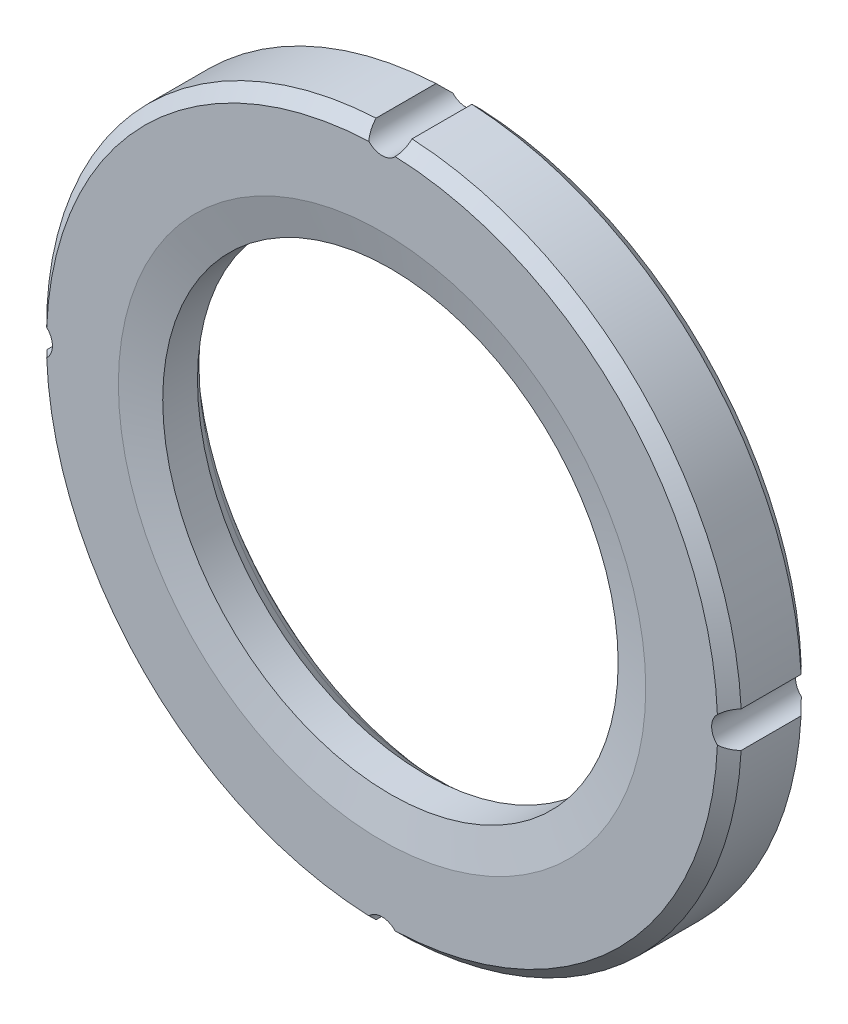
ISO-10303-21;
HEADER;
FILE_DESCRIPTION(('STEP AP214'),'2;1');
FILE_NAME('part.step','',(''),(''),'','','');
FILE_SCHEMA(('AUTOMOTIVE_DESIGN { 1 0 10303 214 1 1 1 1 }'));
ENDSEC;
DATA;
#1=APPLICATION_CONTEXT('core data for automotive mechanical design processes');
#2=APPLICATION_PROTOCOL_DEFINITION('international standard','automotive_design',2000,#1);
#3=PRODUCT_CONTEXT('',#1,'mechanical');
#4=PRODUCT('Part','Part','',(#3));
#5=PRODUCT_RELATED_PRODUCT_CATEGORY('part','',(#4));
#6=PRODUCT_DEFINITION_FORMATION('','',#4);
#7=PRODUCT_DEFINITION_CONTEXT('part definition',#1,'design');
#8=PRODUCT_DEFINITION('design','',#6,#7);
#9=PRODUCT_DEFINITION_SHAPE('','',#8);
#10=(LENGTH_UNIT() NAMED_UNIT(*) SI_UNIT(.MILLI.,.METRE.));
#11=(NAMED_UNIT(*) PLANE_ANGLE_UNIT() SI_UNIT($,.RADIAN.));
#12=(NAMED_UNIT(*) SI_UNIT($,.STERADIAN.) SOLID_ANGLE_UNIT());
#13=UNCERTAINTY_MEASURE_WITH_UNIT(LENGTH_MEASURE(1.E-05),#10,'distance_accuracy_value','');
#14=(GEOMETRIC_REPRESENTATION_CONTEXT(3) GLOBAL_UNCERTAINTY_ASSIGNED_CONTEXT((#13)) GLOBAL_UNIT_ASSIGNED_CONTEXT((#10,
#11,#12)) REPRESENTATION_CONTEXT('',''));
#15=CARTESIAN_POINT('',(0.,0.,0.));
#16=DIRECTION('',(0.,0.,1.));
#17=DIRECTION('',(1.,0.,0.));
#18=AXIS2_PLACEMENT_3D('',#15,#16,#17);
#19=CARTESIAN_POINT('',(22.7896017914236,0.,0.));
#20=DIRECTION('',(0.,0.,1.));
#21=DIRECTION('',(1.,0.,0.));
#22=AXIS2_PLACEMENT_3D('',#19,#20,#21);
#23=PLANE('',#22);
#24=CARTESIAN_POINT('',(0.,0.,0.));
#25=DIRECTION('',(0.,0.,-1.));
#26=DIRECTION('',(-1.,0.,0.));
#27=AXIS2_PLACEMENT_3D('',#24,#25,#26);
#28=CIRCLE('',#27,22.7896017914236);
#29=CARTESIAN_POINT('',(-22.7896017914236,0.,0.));
#30=VERTEX_POINT('',#29);
#31=EDGE_CURVE('E175',#30,#30,#28,.T.);
#32=ORIENTED_EDGE('',*,*,#31,.F.);
#33=EDGE_LOOP('',(#32));
#34=FACE_BOUND('',#33,.T.);
#35=CARTESIAN_POINT('',(-29.,0.,0.));
#36=DIRECTION('',(0.,0.,1.));
#37=DIRECTION('',(1.,0.,0.));
#38=AXIS2_PLACEMENT_3D('',#35,#36,#37);
#39=CIRCLE('',#38,1.5);
#40=CARTESIAN_POINT('',(-27.9784482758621,-1.09837701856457,0.));
#41=VERTEX_POINT('',#40);
#42=CARTESIAN_POINT('',(-27.9784482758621,1.09837701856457,0.));
#43=VERTEX_POINT('',#42);
#44=EDGE_CURVE('E143',#41,#43,#39,.T.);
#45=ORIENTED_EDGE('',*,*,#44,.T.);
#46=CARTESIAN_POINT('',(0.,0.,0.));
#47=DIRECTION('',(0.,0.,-1.));
#48=DIRECTION('',(-1.,0.,0.));
#49=AXIS2_PLACEMENT_3D('',#46,#47,#48);
#50=CIRCLE('',#49,28.);
#51=CARTESIAN_POINT('',(-1.09837701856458,27.9784482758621,0.));
#52=VERTEX_POINT('',#51);
#53=EDGE_CURVE('E168',#43,#52,#50,.T.);
#54=ORIENTED_EDGE('',*,*,#53,.T.);
#55=CARTESIAN_POINT('',(0.,29.,0.));
#56=DIRECTION('',(0.,0.,1.));
#57=DIRECTION('',(1.,0.,0.));
#58=AXIS2_PLACEMENT_3D('',#55,#56,#57);
#59=CIRCLE('',#58,1.5);
#60=CARTESIAN_POINT('',(1.09837701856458,27.9784482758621,0.));
#61=VERTEX_POINT('',#60);
#62=EDGE_CURVE('E340',#52,#61,#59,.T.);
#63=ORIENTED_EDGE('',*,*,#62,.T.);
#64=CARTESIAN_POINT('',(27.9784482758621,1.09837701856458,0.));
#65=VERTEX_POINT('',#64);
#66=EDGE_CURVE('E170',#61,#65,#50,.T.);
#67=ORIENTED_EDGE('',*,*,#66,.T.);
#68=CARTESIAN_POINT('',(29.,0.,0.));
#69=DIRECTION('',(0.,0.,1.));
#70=DIRECTION('',(1.,0.,0.));
#71=AXIS2_PLACEMENT_3D('',#68,#69,#70);
#72=CIRCLE('',#71,1.5);
#73=CARTESIAN_POINT('',(27.9784482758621,-1.0983770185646,0.));
#74=VERTEX_POINT('',#73);
#75=EDGE_CURVE('E436',#65,#74,#72,.T.);
#76=ORIENTED_EDGE('',*,*,#75,.T.);
#77=CARTESIAN_POINT('',(1.09837701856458,-27.9784482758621,0.));
#78=VERTEX_POINT('',#77);
#79=EDGE_CURVE('E167',#74,#78,#50,.T.);
#80=ORIENTED_EDGE('',*,*,#79,.T.);
#81=CARTESIAN_POINT('',(0.,-29.,0.));
#82=DIRECTION('',(0.,0.,1.));
#83=DIRECTION('',(1.,0.,0.));
#84=AXIS2_PLACEMENT_3D('',#81,#82,#83);
#85=CIRCLE('',#84,1.5);
#86=CARTESIAN_POINT('',(-1.09837701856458,-27.9784482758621,0.));
#87=VERTEX_POINT('',#86);
#88=EDGE_CURVE('E163',#78,#87,#85,.T.);
#89=ORIENTED_EDGE('',*,*,#88,.T.);
#90=EDGE_CURVE('E160',#87,#41,#50,.T.);
#91=ORIENTED_EDGE('',*,*,#90,.T.);
#92=EDGE_LOOP('',(#45,#54,#63,#67,#76,#80,#89,#91));
#93=FACE_BOUND('',#92,.T.);
#94=ADVANCED_FACE('F33',(#34,#93),#23,.F.);
#95=CARTESIAN_POINT('',(0.,0.,1.));
#96=DIRECTION('',(0.,0.,1.));
#97=DIRECTION('',(1.,0.,0.));
#98=AXIS2_PLACEMENT_3D('',#95,#96,#97);
#99=CONICAL_SURFACE('',#98,29.,0.785398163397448);
#100=CARTESIAN_POINT('',(-27.9782551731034,-1.09819739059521,-0.000199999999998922));
#101=CARTESIAN_POINT('',(-28.0157579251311,-1.13306937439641,0.0386435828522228));
#102=CARTESIAN_POINT('',(-28.0543848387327,-1.1654460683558,0.0785683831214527));
#103=CARTESIAN_POINT('',(-28.1334468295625,-1.22537929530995,0.160105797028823));
#104=CARTESIAN_POINT('',(-28.1738798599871,-1.25294111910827,0.201716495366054));
#105=CARTESIAN_POINT('',(-28.2554341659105,-1.30302180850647,0.285453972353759));
#106=CARTESIAN_POINT('',(-28.296528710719,-1.32562482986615,0.327556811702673));
#107=CARTESIAN_POINT('',(-28.3798356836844,-1.36658407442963,0.41271345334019));
#108=CARTESIAN_POINT('',(-28.4220484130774,-1.38493914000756,0.455767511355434));
#109=CARTESIAN_POINT('',(-28.5445590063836,-1.43174091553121,0.580430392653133));
#110=CARTESIAN_POINT('',(-28.6259829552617,-1.45503911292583,0.662935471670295));
#111=CARTESIAN_POINT('',(-28.7500755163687,-1.47964834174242,0.78812559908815));
#112=CARTESIAN_POINT('',(-28.7921498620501,-1.48613846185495,0.830478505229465));
#113=CARTESIAN_POINT('',(-28.8765901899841,-1.49551658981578,0.915290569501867));
#114=CARTESIAN_POINT('',(-28.918956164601,-1.49840469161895,0.957749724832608));
#115=CARTESIAN_POINT('',(-28.9614068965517,-1.49950344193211,1.00019999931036));
#116=B_SPLINE_CURVE_WITH_KNOTS('',3,(#100,#101,#102,#103,#104,#105,#106,#107,#108,#109,#110,
#111,#112,#113,#114,#115),.UNSPECIFIED.,.F.,.F.,(4,2,2,2,2,2,2,4),(0.,0.192694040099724,
0.38517498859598,0.574080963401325,0.763038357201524,1.11669354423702,1.29676096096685,
1.47682368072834),.UNSPECIFIED.);
#117=CARTESIAN_POINT('',(-28.9612068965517,-1.49949828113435,0.999999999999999));
#118=VERTEX_POINT('',#117);
#119=EDGE_CURVE('E146',#41,#118,#116,.T.);
#120=ORIENTED_EDGE('',*,*,#119,.F.);
#121=ORIENTED_EDGE('',*,*,#90,.F.);
#122=CARTESIAN_POINT('',(-1.49950344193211,-28.9614068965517,1.00019999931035));
#123=CARTESIAN_POINT('',(-1.49797297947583,-28.9026287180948,0.941424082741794));
#124=CARTESIAN_POINT('',(-1.49302163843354,-28.8439774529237,0.882592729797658));
#125=CARTESIAN_POINT('',(-1.47618187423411,-28.7272678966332,0.765169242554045));
#126=CARTESIAN_POINT('',(-1.46428351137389,-28.6692105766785,0.706577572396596));
#127=CARTESIAN_POINT('',(-1.43384977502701,-28.5556598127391,0.591633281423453));
#128=CARTESIAN_POINT('',(-1.41549066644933,-28.5001387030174,0.535261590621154));
#129=CARTESIAN_POINT('',(-1.37191508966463,-28.390641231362,0.42376291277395));
#130=CARTESIAN_POINT('',(-1.34670412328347,-28.3366636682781,0.368634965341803));
#131=CARTESIAN_POINT('',(-1.28904111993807,-28.2305603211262,0.259961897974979));
#132=CARTESIAN_POINT('',(-1.25656533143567,-28.1784412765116,0.206422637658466));
#133=CARTESIAN_POINT('',(-1.1835572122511,-28.0763361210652,0.101251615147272));
#134=CARTESIAN_POINT('',(-1.14292620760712,-28.0263862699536,0.0496534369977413));
#135=CARTESIAN_POINT('',(-1.09819739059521,-27.9782551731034,-0.000199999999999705));
#136=B_SPLINE_CURVE_WITH_KNOTS('',3,(#122,#123,#124,#125,#126,#127,#128,#129,#130,#131,#132,
#133,#134,#135),.UNSPECIFIED.,.F.,.F.,(4,2,2,2,2,2,4),(0.,0.249360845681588,0.499079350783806,
0.742454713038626,0.985635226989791,1.22962272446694,1.47676269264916),.UNSPECIFIED.);
#137=CARTESIAN_POINT('',(-1.49949828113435,-28.9612068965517,0.999999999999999));
#138=VERTEX_POINT('',#137);
#139=EDGE_CURVE('E197',#138,#87,#136,.T.);
#140=ORIENTED_EDGE('',*,*,#139,.F.);
#141=CARTESIAN_POINT('',(0.,0.,1.));
#142=DIRECTION('',(0.,0.,-1.));
#143=DIRECTION('',(-1.,0.,0.));
#144=AXIS2_PLACEMENT_3D('',#141,#142,#143);
#145=CIRCLE('',#144,29.);
#146=EDGE_CURVE('E162',#138,#118,#145,.T.);
#147=ORIENTED_EDGE('',*,*,#146,.T.);
#148=EDGE_LOOP('',(#120,#121,#140,#147));
#149=FACE_BOUND('',#148,.T.);
#150=ADVANCED_FACE('F158',(#149),#99,.T.);
#151=CARTESIAN_POINT('',(-28.9614068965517,1.49950344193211,1.00019999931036));
#152=CARTESIAN_POINT('',(-28.9026287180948,1.49797297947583,0.941424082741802));
#153=CARTESIAN_POINT('',(-28.8439774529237,1.49302163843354,0.882592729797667));
#154=CARTESIAN_POINT('',(-28.7272678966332,1.47618187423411,0.765169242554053));
#155=CARTESIAN_POINT('',(-28.6692105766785,1.46428351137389,0.706577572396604));
#156=CARTESIAN_POINT('',(-28.5556598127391,1.43384977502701,0.59163328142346));
#157=CARTESIAN_POINT('',(-28.5001387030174,1.41549066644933,0.535261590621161));
#158=CARTESIAN_POINT('',(-28.390641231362,1.37191508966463,0.423762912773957));
#159=CARTESIAN_POINT('',(-28.3366636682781,1.34670412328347,0.36863496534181));
#160=CARTESIAN_POINT('',(-28.2305603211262,1.28904111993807,0.259961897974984));
#161=CARTESIAN_POINT('',(-28.1784412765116,1.25656533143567,0.20642263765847));
#162=CARTESIAN_POINT('',(-28.0763361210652,1.18355721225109,0.101251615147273));
#163=CARTESIAN_POINT('',(-28.0263862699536,1.14292620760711,0.0496534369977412));
#164=CARTESIAN_POINT('',(-27.9782551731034,1.09819739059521,-0.000199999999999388));
#165=B_SPLINE_CURVE_WITH_KNOTS('',3,(#151,#152,#153,#154,#155,#156,#157,#158,#159,#160,#161,
#162,#163,#164),.UNSPECIFIED.,.F.,.F.,(4,2,2,2,2,2,4),(0.,0.249360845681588,0.499079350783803,
0.742454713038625,0.985635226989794,1.22962272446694,1.47676269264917),.UNSPECIFIED.);
#166=CARTESIAN_POINT('',(-28.9612068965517,1.49949828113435,0.999999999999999));
#167=VERTEX_POINT('',#166);
#168=EDGE_CURVE('E149',#167,#43,#165,.T.);
#169=ORIENTED_EDGE('',*,*,#168,.F.);
#170=CARTESIAN_POINT('',(-1.49949828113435,28.9612068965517,0.999999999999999));
#171=VERTEX_POINT('',#170);
#172=EDGE_CURVE('E212',#167,#171,#145,.T.);
#173=ORIENTED_EDGE('',*,*,#172,.T.);
#174=CARTESIAN_POINT('',(-1.09819739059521,27.9782551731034,-0.000199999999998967));
#175=CARTESIAN_POINT('',(-1.13306937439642,28.0157579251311,0.0386435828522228));
#176=CARTESIAN_POINT('',(-1.16544606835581,28.0543848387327,0.0785683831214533));
#177=CARTESIAN_POINT('',(-1.22537929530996,28.1334468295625,0.160105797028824));
#178=CARTESIAN_POINT('',(-1.25294111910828,28.1738798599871,0.201716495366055));
#179=CARTESIAN_POINT('',(-1.30302180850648,28.2554341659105,0.28545397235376));
#180=CARTESIAN_POINT('',(-1.32562482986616,28.296528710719,0.327556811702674));
#181=CARTESIAN_POINT('',(-1.36658407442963,28.3798356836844,0.412713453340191));
#182=CARTESIAN_POINT('',(-1.38493914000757,28.4220484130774,0.455767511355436));
#183=CARTESIAN_POINT('',(-1.43174091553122,28.5445590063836,0.580430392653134));
#184=CARTESIAN_POINT('',(-1.45503911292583,28.6259829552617,0.662935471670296));
#185=CARTESIAN_POINT('',(-1.47964834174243,28.7500755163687,0.78812559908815));
#186=CARTESIAN_POINT('',(-1.48613846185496,28.7921498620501,0.830478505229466));
#187=CARTESIAN_POINT('',(-1.49551658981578,28.8765901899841,0.915290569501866));
#188=CARTESIAN_POINT('',(-1.49840469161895,28.918956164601,0.957749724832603));
#189=CARTESIAN_POINT('',(-1.49950344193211,28.9614068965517,1.00019999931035));
#190=B_SPLINE_CURVE_WITH_KNOTS('',3,(#174,#175,#176,#177,#178,#179,#180,#181,#182,#183,#184,
#185,#186,#187,#188,#189),.UNSPECIFIED.,.F.,.F.,(4,2,2,2,2,2,2,4),(0.,0.192694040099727,
0.385174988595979,0.57408096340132,0.763038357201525,1.11669354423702,1.29676096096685,
1.47682368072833),.UNSPECIFIED.);
#191=EDGE_CURVE('E287',#52,#171,#190,.T.);
#192=ORIENTED_EDGE('',*,*,#191,.F.);
#193=ORIENTED_EDGE('',*,*,#53,.F.);
#194=EDGE_LOOP('',(#169,#173,#192,#193));
#195=FACE_BOUND('',#194,.T.);
#196=ADVANCED_FACE('F328',(#195),#99,.T.);
#197=CARTESIAN_POINT('',(0.,0.,-37.9288784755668));
#198=DIRECTION('',(0.,0.,-1.));
#199=DIRECTION('',(-1.,0.,0.));
#200=AXIS2_PLACEMENT_3D('',#197,#198,#199);
#201=CYLINDRICAL_SURFACE('',#200,29.);
#202=DIRECTION('',(0.,0.,-1.));
#203=VECTOR('',#202,1.);
#204=CARTESIAN_POINT('',(-28.9612068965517,1.49949828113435,10.));
#205=LINE('',#204,#203);
#206=CARTESIAN_POINT('',(-28.9612068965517,1.49949828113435,5.99999999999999));
#207=VERTEX_POINT('',#206);
#208=EDGE_CURVE('E153',#207,#167,#205,.T.);
#209=ORIENTED_EDGE('',*,*,#208,.F.);
#210=CARTESIAN_POINT('',(0.,0.,6.));
#211=DIRECTION('',(0.,0.,-1.));
#212=DIRECTION('',(-1.,0.,0.));
#213=AXIS2_PLACEMENT_3D('',#210,#211,#212);
#214=CIRCLE('',#213,29.);
#215=CARTESIAN_POINT('',(-1.49949828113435,28.9612068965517,6.));
#216=VERTEX_POINT('',#215);
#217=EDGE_CURVE('E208',#207,#216,#214,.T.);
#218=ORIENTED_EDGE('',*,*,#217,.T.);
#219=DIRECTION('',(0.,0.,-1.));
#220=VECTOR('',#219,1.);
#221=CARTESIAN_POINT('',(-1.49949828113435,28.9612068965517,10.));
#222=LINE('',#221,#220);
#223=EDGE_CURVE('E331',#216,#171,#222,.T.);
#224=ORIENTED_EDGE('',*,*,#223,.T.);
#225=ORIENTED_EDGE('',*,*,#172,.F.);
#226=EDGE_LOOP('',(#209,#218,#224,#225));
#227=FACE_BOUND('',#226,.T.);
#228=ADVANCED_FACE('F275',(#227),#201,.T.);
#229=DIRECTION('',(0.,0.,-1.));
#230=VECTOR('',#229,1.);
#231=CARTESIAN_POINT('',(-28.9612068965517,-1.49949828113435,10.));
#232=LINE('',#231,#230);
#233=CARTESIAN_POINT('',(-28.9612068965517,-1.49949828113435,5.99999999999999));
#234=VERTEX_POINT('',#233);
#235=EDGE_CURVE('E226',#234,#118,#232,.T.);
#236=ORIENTED_EDGE('',*,*,#235,.T.);
#237=ORIENTED_EDGE('',*,*,#146,.F.);
#238=DIRECTION('',(0.,0.,-1.));
#239=VECTOR('',#238,1.);
#240=CARTESIAN_POINT('',(-1.49949828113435,-28.9612068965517,10.));
#241=LINE('',#240,#239);
#242=CARTESIAN_POINT('',(-1.49949828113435,-28.9612068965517,6.));
#243=VERTEX_POINT('',#242);
#244=EDGE_CURVE('E227',#243,#138,#241,.T.);
#245=ORIENTED_EDGE('',*,*,#244,.F.);
#246=EDGE_CURVE('E196',#243,#234,#214,.T.);
#247=ORIENTED_EDGE('',*,*,#246,.T.);
#248=EDGE_LOOP('',(#236,#237,#245,#247));
#249=FACE_BOUND('',#248,.T.);
#250=ADVANCED_FACE('F225',(#249),#201,.T.);
#251=CARTESIAN_POINT('',(0.,0.,7.));
#252=DIRECTION('',(0.,0.,-1.));
#253=DIRECTION('',(-1.,0.,0.));
#254=AXIS2_PLACEMENT_3D('',#251,#252,#253);
#255=CONICAL_SURFACE('',#254,28.,0.785398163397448);
#256=CARTESIAN_POINT('',(-27.9782551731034,1.09819739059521,7.0002));
#257=CARTESIAN_POINT('',(-28.0157579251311,1.13306937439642,6.96135641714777));
#258=CARTESIAN_POINT('',(-28.0543848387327,1.16544606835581,6.92143161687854));
#259=CARTESIAN_POINT('',(-28.1334468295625,1.22537929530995,6.83989420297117));
#260=CARTESIAN_POINT('',(-28.1738798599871,1.25294111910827,6.79828350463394));
#261=CARTESIAN_POINT('',(-28.2554341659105,1.30302180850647,6.71454602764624));
#262=CARTESIAN_POINT('',(-28.296528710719,1.32562482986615,6.67244318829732));
#263=CARTESIAN_POINT('',(-28.3798356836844,1.36658407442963,6.58728654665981));
#264=CARTESIAN_POINT('',(-28.4220484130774,1.38493914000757,6.54423248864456));
#265=CARTESIAN_POINT('',(-28.5445590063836,1.43174091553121,6.41956960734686));
#266=CARTESIAN_POINT('',(-28.6259829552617,1.45503911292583,6.3370645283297));
#267=CARTESIAN_POINT('',(-28.7500755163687,1.47964834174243,6.21187440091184));
#268=CARTESIAN_POINT('',(-28.7921498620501,1.48613846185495,6.16952149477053));
#269=CARTESIAN_POINT('',(-28.8765901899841,1.49551658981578,6.08470943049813));
#270=CARTESIAN_POINT('',(-28.918956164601,1.49840469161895,6.04225027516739));
#271=CARTESIAN_POINT('',(-28.9614068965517,1.49950344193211,5.99980000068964));
#272=B_SPLINE_CURVE_WITH_KNOTS('',3,(#256,#257,#258,#259,#260,#261,#262,#263,#264,#265,#266,
#267,#268,#269,#270,#271),.UNSPECIFIED.,.F.,.F.,(4,2,2,2,2,2,2,4),(0.,0.192694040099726,
0.385174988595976,0.574080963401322,0.763038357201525,1.11669354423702,1.29676096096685,
1.47682368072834),.UNSPECIFIED.);
#273=CARTESIAN_POINT('',(-27.9784482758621,1.09837701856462,7.));
#274=VERTEX_POINT('',#273);
#275=EDGE_CURVE('E312',#274,#207,#272,.T.);
#276=ORIENTED_EDGE('',*,*,#275,.F.);
#277=CARTESIAN_POINT('',(0.,0.,7.));
#278=DIRECTION('',(0.,0.,-1.));
#279=DIRECTION('',(-1.,0.,0.));
#280=AXIS2_PLACEMENT_3D('',#277,#278,#279);
#281=CIRCLE('',#280,28.);
#282=CARTESIAN_POINT('',(-1.09837701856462,27.9784482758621,7.));
#283=VERTEX_POINT('',#282);
#284=EDGE_CURVE('E202',#274,#283,#281,.T.);
#285=ORIENTED_EDGE('',*,*,#284,.T.);
#286=CARTESIAN_POINT('',(-1.49950344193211,28.9614068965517,5.99980000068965));
#287=CARTESIAN_POINT('',(-1.49797297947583,28.9026287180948,6.05857591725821));
#288=CARTESIAN_POINT('',(-1.49302163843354,28.8439774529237,6.11740727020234));
#289=CARTESIAN_POINT('',(-1.47618187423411,28.7272678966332,6.23483075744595));
#290=CARTESIAN_POINT('',(-1.46428351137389,28.6692105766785,6.2934224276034));
#291=CARTESIAN_POINT('',(-1.43384977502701,28.5556598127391,6.40836671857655));
#292=CARTESIAN_POINT('',(-1.41549066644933,28.5001387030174,6.46473840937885));
#293=CARTESIAN_POINT('',(-1.37191508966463,28.390641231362,6.57623708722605));
#294=CARTESIAN_POINT('',(-1.34670412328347,28.3366636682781,6.6313650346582));
#295=CARTESIAN_POINT('',(-1.28904111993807,28.2305603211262,6.74003810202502));
#296=CARTESIAN_POINT('',(-1.25656533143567,28.1784412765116,6.79357736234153));
#297=CARTESIAN_POINT('',(-1.1835572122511,28.0763361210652,6.89874838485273));
#298=CARTESIAN_POINT('',(-1.14292620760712,28.0263862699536,6.95034656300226));
#299=CARTESIAN_POINT('',(-1.09819739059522,27.9782551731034,7.0002));
#300=B_SPLINE_CURVE_WITH_KNOTS('',3,(#286,#287,#288,#289,#290,#291,#292,#293,#294,#295,#296,
#297,#298,#299),.UNSPECIFIED.,.F.,.F.,(4,2,2,2,2,2,4),(0.,0.249360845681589,0.499079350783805,
0.742454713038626,0.985635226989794,1.22962272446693,1.47676269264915),.UNSPECIFIED.);
#301=EDGE_CURVE('E335',#216,#283,#300,.T.);
#302=ORIENTED_EDGE('',*,*,#301,.F.);
#303=ORIENTED_EDGE('',*,*,#217,.F.);
#304=EDGE_LOOP('',(#276,#285,#302,#303));
#305=FACE_BOUND('',#304,.T.);
#306=ADVANCED_FACE('F243',(#305),#255,.T.);
#307=CARTESIAN_POINT('',(-28.9614068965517,-1.49950344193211,5.99980000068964));
#308=CARTESIAN_POINT('',(-28.9026287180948,-1.49797297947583,6.0585759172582));
#309=CARTESIAN_POINT('',(-28.8439774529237,-1.49302163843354,6.11740727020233));
#310=CARTESIAN_POINT('',(-28.7272678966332,-1.47618187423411,6.23483075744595));
#311=CARTESIAN_POINT('',(-28.6692105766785,-1.46428351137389,6.29342242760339));
#312=CARTESIAN_POINT('',(-28.5556598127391,-1.43384977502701,6.40836671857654));
#313=CARTESIAN_POINT('',(-28.5001387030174,-1.41549066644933,6.46473840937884));
#314=CARTESIAN_POINT('',(-28.390641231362,-1.37191508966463,6.57623708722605));
#315=CARTESIAN_POINT('',(-28.3366636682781,-1.34670412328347,6.63136503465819));
#316=CARTESIAN_POINT('',(-28.2305603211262,-1.28904111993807,6.74003810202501));
#317=CARTESIAN_POINT('',(-28.1784412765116,-1.25656533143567,6.79357736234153));
#318=CARTESIAN_POINT('',(-28.0763361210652,-1.18355721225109,6.89874838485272));
#319=CARTESIAN_POINT('',(-28.0263862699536,-1.14292620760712,6.95034656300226));
#320=CARTESIAN_POINT('',(-27.9782551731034,-1.09819739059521,7.0002));
#321=B_SPLINE_CURVE_WITH_KNOTS('',3,(#307,#308,#309,#310,#311,#312,#313,#314,#315,#316,#317,
#318,#319,#320),.UNSPECIFIED.,.F.,.F.,(4,2,2,2,2,2,4),(0.,0.249360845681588,0.499079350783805,
0.742454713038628,0.985635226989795,1.22962272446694,1.47676269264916),.UNSPECIFIED.);
#322=CARTESIAN_POINT('',(-27.9784482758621,-1.09837701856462,7.));
#323=VERTEX_POINT('',#322);
#324=EDGE_CURVE('E47',#234,#323,#321,.T.);
#325=ORIENTED_EDGE('',*,*,#324,.F.);
#326=ORIENTED_EDGE('',*,*,#246,.F.);
#327=CARTESIAN_POINT('',(-1.09819739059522,-27.9782551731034,7.0002));
#328=CARTESIAN_POINT('',(-1.13306937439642,-28.0157579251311,6.96135641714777));
#329=CARTESIAN_POINT('',(-1.16544606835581,-28.0543848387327,6.92143161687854));
#330=CARTESIAN_POINT('',(-1.22537929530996,-28.1334468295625,6.83989420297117));
#331=CARTESIAN_POINT('',(-1.25294111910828,-28.1738798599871,6.79828350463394));
#332=CARTESIAN_POINT('',(-1.30302180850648,-28.2554341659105,6.71454602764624));
#333=CARTESIAN_POINT('',(-1.32562482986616,-28.296528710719,6.67244318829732));
#334=CARTESIAN_POINT('',(-1.36658407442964,-28.3798356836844,6.58728654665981));
#335=CARTESIAN_POINT('',(-1.38493914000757,-28.4220484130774,6.54423248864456));
#336=CARTESIAN_POINT('',(-1.43174091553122,-28.5445590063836,6.41956960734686));
#337=CARTESIAN_POINT('',(-1.45503911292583,-28.6259829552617,6.3370645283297));
#338=CARTESIAN_POINT('',(-1.47964834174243,-28.7500755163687,6.21187440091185));
#339=CARTESIAN_POINT('',(-1.48613846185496,-28.7921498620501,6.16952149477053));
#340=CARTESIAN_POINT('',(-1.49551658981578,-28.8765901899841,6.08470943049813));
#341=CARTESIAN_POINT('',(-1.49840469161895,-28.918956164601,6.04225027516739));
#342=CARTESIAN_POINT('',(-1.49950344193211,-28.9614068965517,5.99980000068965));
#343=B_SPLINE_CURVE_WITH_KNOTS('',3,(#327,#328,#329,#330,#331,#332,#333,#334,#335,#336,#337,
#338,#339,#340,#341,#342),.UNSPECIFIED.,.F.,.F.,(4,2,2,2,2,2,2,4),(0.,0.192694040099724,
0.385174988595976,0.574080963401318,0.763038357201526,1.11669354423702,1.29676096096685,
1.47682368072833),.UNSPECIFIED.);
#344=CARTESIAN_POINT('',(-1.09837701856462,-27.9784482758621,7.));
#345=VERTEX_POINT('',#344);
#346=EDGE_CURVE('E184',#345,#243,#343,.T.);
#347=ORIENTED_EDGE('',*,*,#346,.F.);
#348=EDGE_CURVE('E194',#345,#323,#281,.T.);
#349=ORIENTED_EDGE('',*,*,#348,.T.);
#350=EDGE_LOOP('',(#325,#326,#347,#349));
#351=FACE_BOUND('',#350,.T.);
#352=ADVANCED_FACE('F193',(#351),#255,.T.);
#353=CARTESIAN_POINT('',(28.,0.,7.));
#354=DIRECTION('',(0.,0.,-1.));
#355=DIRECTION('',(-1.,0.,0.));
#356=AXIS2_PLACEMENT_3D('',#353,#354,#355);
#357=PLANE('',#356);
#358=CARTESIAN_POINT('',(0.,0.,7.));
#359=DIRECTION('',(0.,0.,-1.));
#360=DIRECTION('',(-1.,0.,0.));
#361=AXIS2_PLACEMENT_3D('',#358,#359,#360);
#362=CIRCLE('',#361,22.);
#363=CARTESIAN_POINT('',(-22.,0.,7.));
#364=VERTEX_POINT('',#363);
#365=EDGE_CURVE('E205',#364,#364,#362,.T.);
#366=ORIENTED_EDGE('',*,*,#365,.T.);
#367=EDGE_LOOP('',(#366));
#368=FACE_BOUND('',#367,.T.);
#369=CARTESIAN_POINT('',(-29.,0.,7.));
#370=DIRECTION('',(0.,0.,-1.));
#371=DIRECTION('',(-1.,0.,0.));
#372=AXIS2_PLACEMENT_3D('',#369,#370,#371);
#373=CIRCLE('',#372,1.5);
#374=EDGE_CURVE('E11',#323,#274,#373,.F.);
#375=ORIENTED_EDGE('',*,*,#374,.F.);
#376=ORIENTED_EDGE('',*,*,#348,.F.);
#377=CARTESIAN_POINT('',(0.,-29.,7.));
#378=DIRECTION('',(0.,0.,-1.));
#379=DIRECTION('',(-1.,0.,0.));
#380=AXIS2_PLACEMENT_3D('',#377,#378,#379);
#381=CIRCLE('',#380,1.5);
#382=CARTESIAN_POINT('',(1.09837701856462,-27.9784482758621,7.));
#383=VERTEX_POINT('',#382);
#384=EDGE_CURVE('E41',#383,#345,#381,.F.);
#385=ORIENTED_EDGE('',*,*,#384,.F.);
#386=CARTESIAN_POINT('',(27.9784482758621,-1.09837701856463,7.));
#387=VERTEX_POINT('',#386);
#388=EDGE_CURVE('E201',#387,#383,#281,.T.);
#389=ORIENTED_EDGE('',*,*,#388,.F.);
#390=CARTESIAN_POINT('',(29.,0.,7.));
#391=DIRECTION('',(0.,0.,-1.));
#392=DIRECTION('',(-1.,0.,0.));
#393=AXIS2_PLACEMENT_3D('',#390,#391,#392);
#394=CIRCLE('',#393,1.5);
#395=CARTESIAN_POINT('',(27.9784482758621,1.09837701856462,7.));
#396=VERTEX_POINT('',#395);
#397=EDGE_CURVE('E181',#396,#387,#394,.F.);
#398=ORIENTED_EDGE('',*,*,#397,.F.);
#399=CARTESIAN_POINT('',(1.09837701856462,27.9784482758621,7.));
#400=VERTEX_POINT('',#399);
#401=EDGE_CURVE('E204',#400,#396,#281,.T.);
#402=ORIENTED_EDGE('',*,*,#401,.F.);
#403=CARTESIAN_POINT('',(0.,29.,7.));
#404=DIRECTION('',(0.,0.,-1.));
#405=DIRECTION('',(-1.,0.,0.));
#406=AXIS2_PLACEMENT_3D('',#403,#404,#405);
#407=CIRCLE('',#406,1.5);
#408=EDGE_CURVE('E179',#283,#400,#407,.F.);
#409=ORIENTED_EDGE('',*,*,#408,.F.);
#410=ORIENTED_EDGE('',*,*,#284,.F.);
#411=EDGE_LOOP('',(#375,#376,#385,#389,#398,#402,#409,#410));
#412=FACE_BOUND('',#411,.T.);
#413=ADVANCED_FACE('F199',(#368,#412),#357,.F.);
#414=CARTESIAN_POINT('',(1.09819739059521,-27.9782551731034,-0.000199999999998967));
#415=CARTESIAN_POINT('',(1.13306937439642,-28.0157579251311,0.038643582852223));
#416=CARTESIAN_POINT('',(1.16544606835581,-28.0543848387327,0.0785683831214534));
#417=CARTESIAN_POINT('',(1.22537929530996,-28.1334468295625,0.160105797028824));
#418=CARTESIAN_POINT('',(1.25294111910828,-28.1738798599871,0.201716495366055));
#419=CARTESIAN_POINT('',(1.30302180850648,-28.2554341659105,0.285453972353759));
#420=CARTESIAN_POINT('',(1.32562482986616,-28.296528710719,0.327556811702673));
#421=CARTESIAN_POINT('',(1.36658407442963,-28.3798356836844,0.41271345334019));
#422=CARTESIAN_POINT('',(1.38493914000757,-28.4220484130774,0.455767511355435));
#423=CARTESIAN_POINT('',(1.43174091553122,-28.5445590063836,0.580430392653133));
#424=CARTESIAN_POINT('',(1.45503911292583,-28.6259829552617,0.662935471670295));
#425=CARTESIAN_POINT('',(1.47964834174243,-28.7500755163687,0.788125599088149));
#426=CARTESIAN_POINT('',(1.48613846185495,-28.7921498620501,0.830478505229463));
#427=CARTESIAN_POINT('',(1.49551658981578,-28.8765901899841,0.915290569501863));
#428=CARTESIAN_POINT('',(1.49840469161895,-28.918956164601,0.957749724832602));
#429=CARTESIAN_POINT('',(1.49950344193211,-28.9614068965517,1.00019999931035));
#430=B_SPLINE_CURVE_WITH_KNOTS('',3,(#414,#415,#416,#417,#418,#419,#420,#421,#422,#423,#424,
#425,#426,#427,#428,#429),.UNSPECIFIED.,.F.,.F.,(4,2,2,2,2,2,2,4),(0.,0.192694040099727,
0.385174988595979,0.57408096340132,0.763038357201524,1.11669354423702,1.29676096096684,
1.47682368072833),.UNSPECIFIED.);
#431=CARTESIAN_POINT('',(1.49949828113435,-28.9612068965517,0.999999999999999));
#432=VERTEX_POINT('',#431);
#433=EDGE_CURVE('E263',#78,#432,#430,.T.);
#434=ORIENTED_EDGE('',*,*,#433,.F.);
#435=ORIENTED_EDGE('',*,*,#79,.F.);
#436=CARTESIAN_POINT('',(28.9614068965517,-1.49950344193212,1.00019999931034));
#437=CARTESIAN_POINT('',(28.9026287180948,-1.49797297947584,0.941424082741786));
#438=CARTESIAN_POINT('',(28.8439774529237,-1.49302163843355,0.88259272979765));
#439=CARTESIAN_POINT('',(28.7272678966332,-1.47618187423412,0.765169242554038));
#440=CARTESIAN_POINT('',(28.6692105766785,-1.4642835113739,0.70657757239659));
#441=CARTESIAN_POINT('',(28.5556598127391,-1.43384977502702,0.591633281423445));
#442=CARTESIAN_POINT('',(28.5001387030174,-1.41549066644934,0.535261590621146));
#443=CARTESIAN_POINT('',(28.390641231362,-1.37191508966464,0.423762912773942));
#444=CARTESIAN_POINT('',(28.3366636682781,-1.34670412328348,0.368634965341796));
#445=CARTESIAN_POINT('',(28.2305603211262,-1.28904111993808,0.259961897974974));
#446=CARTESIAN_POINT('',(28.1784412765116,-1.25656533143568,0.206422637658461));
#447=CARTESIAN_POINT('',(28.0763361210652,-1.18355721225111,0.101251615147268));
#448=CARTESIAN_POINT('',(28.0263862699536,-1.14292620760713,0.0496534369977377));
#449=CARTESIAN_POINT('',(27.9782551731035,-1.09819739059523,-0.000200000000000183));
#450=B_SPLINE_CURVE_WITH_KNOTS('',3,(#436,#437,#438,#439,#440,#441,#442,#443,#444,#445,#446,
#447,#448,#449),.UNSPECIFIED.,.F.,.F.,(4,2,2,2,2,2,4),(0.,0.249360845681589,0.499079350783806,
0.742454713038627,0.985635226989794,1.22962272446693,1.47676269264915),.UNSPECIFIED.);
#451=CARTESIAN_POINT('',(28.9612068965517,-1.49949828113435,0.999999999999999));
#452=VERTEX_POINT('',#451);
#453=EDGE_CURVE('E294',#452,#74,#450,.T.);
#454=ORIENTED_EDGE('',*,*,#453,.F.);
#455=EDGE_CURVE('E444',#452,#432,#145,.T.);
#456=ORIENTED_EDGE('',*,*,#455,.T.);
#457=EDGE_LOOP('',(#434,#435,#454,#456));
#458=FACE_BOUND('',#457,.T.);
#459=ADVANCED_FACE('F274',(#458),#99,.T.);
#460=DIRECTION('',(0.,0.,-1.));
#461=VECTOR('',#460,1.);
#462=CARTESIAN_POINT('',(1.49949828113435,-28.9612068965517,10.));
#463=LINE('',#462,#461);
#464=CARTESIAN_POINT('',(1.49949828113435,-28.9612068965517,6.));
#465=VERTEX_POINT('',#464);
#466=EDGE_CURVE('E228',#465,#432,#463,.T.);
#467=ORIENTED_EDGE('',*,*,#466,.T.);
#468=ORIENTED_EDGE('',*,*,#455,.F.);
#469=DIRECTION('',(0.,0.,-1.));
#470=VECTOR('',#469,1.);
#471=CARTESIAN_POINT('',(28.9612068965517,-1.49949828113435,10.));
#472=LINE('',#471,#470);
#473=CARTESIAN_POINT('',(28.9612068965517,-1.49949828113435,6.00000000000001));
#474=VERTEX_POINT('',#473);
#475=EDGE_CURVE('E427',#474,#452,#472,.T.);
#476=ORIENTED_EDGE('',*,*,#475,.F.);
#477=EDGE_CURVE('E213',#474,#465,#214,.T.);
#478=ORIENTED_EDGE('',*,*,#477,.T.);
#479=EDGE_LOOP('',(#467,#468,#476,#478));
#480=FACE_BOUND('',#479,.T.);
#481=ADVANCED_FACE('F376',(#480),#201,.T.);
#482=CARTESIAN_POINT('',(1.49950344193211,-28.9614068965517,5.99980000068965));
#483=CARTESIAN_POINT('',(1.49797297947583,-28.9026287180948,6.05857591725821));
#484=CARTESIAN_POINT('',(1.49302163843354,-28.8439774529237,6.11740727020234));
#485=CARTESIAN_POINT('',(1.47618187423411,-28.7272678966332,6.23483075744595));
#486=CARTESIAN_POINT('',(1.46428351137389,-28.6692105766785,6.2934224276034));
#487=CARTESIAN_POINT('',(1.43384977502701,-28.5556598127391,6.40836671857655));
#488=CARTESIAN_POINT('',(1.41549066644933,-28.5001387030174,6.46473840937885));
#489=CARTESIAN_POINT('',(1.37191508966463,-28.390641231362,6.57623708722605));
#490=CARTESIAN_POINT('',(1.34670412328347,-28.3366636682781,6.6313650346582));
#491=CARTESIAN_POINT('',(1.28904111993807,-28.2305603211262,6.74003810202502));
#492=CARTESIAN_POINT('',(1.25656533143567,-28.1784412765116,6.79357736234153));
#493=CARTESIAN_POINT('',(1.1835572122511,-28.0763361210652,6.89874838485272));
#494=CARTESIAN_POINT('',(1.14292620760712,-28.0263862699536,6.95034656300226));
#495=CARTESIAN_POINT('',(1.09819739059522,-27.9782551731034,7.0002));
#496=B_SPLINE_CURVE_WITH_KNOTS('',3,(#482,#483,#484,#485,#486,#487,#488,#489,#490,#491,#492,
#493,#494,#495),.UNSPECIFIED.,.F.,.F.,(4,2,2,2,2,2,4),(0.,0.249360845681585,0.499079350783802,
0.742454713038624,0.985635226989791,1.22962272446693,1.47676269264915),.UNSPECIFIED.);
#497=EDGE_CURVE('E55',#465,#383,#496,.T.);
#498=ORIENTED_EDGE('',*,*,#497,.F.);
#499=ORIENTED_EDGE('',*,*,#477,.F.);
#500=CARTESIAN_POINT('',(27.9782551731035,-1.09819739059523,7.0002));
#501=CARTESIAN_POINT('',(28.0157579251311,-1.13306937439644,6.96135641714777));
#502=CARTESIAN_POINT('',(28.0543848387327,-1.16544606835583,6.92143161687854));
#503=CARTESIAN_POINT('',(28.1334468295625,-1.22537929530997,6.83989420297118));
#504=CARTESIAN_POINT('',(28.1738798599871,-1.25294111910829,6.79828350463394));
#505=CARTESIAN_POINT('',(28.2554341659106,-1.30302180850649,6.71454602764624));
#506=CARTESIAN_POINT('',(28.296528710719,-1.32562482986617,6.67244318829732));
#507=CARTESIAN_POINT('',(28.3798356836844,-1.36658407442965,6.58728654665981));
#508=CARTESIAN_POINT('',(28.4220484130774,-1.38493914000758,6.54423248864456));
#509=CARTESIAN_POINT('',(28.5445590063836,-1.43174091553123,6.41956960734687));
#510=CARTESIAN_POINT('',(28.6259829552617,-1.45503911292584,6.33706452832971));
#511=CARTESIAN_POINT('',(28.7500755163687,-1.47964834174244,6.21187440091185));
#512=CARTESIAN_POINT('',(28.7921498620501,-1.48613846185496,6.16952149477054));
#513=CARTESIAN_POINT('',(28.8765901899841,-1.49551658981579,6.08470943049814));
#514=CARTESIAN_POINT('',(28.918956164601,-1.49840469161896,6.0422502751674));
#515=CARTESIAN_POINT('',(28.9614068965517,-1.49950344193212,5.99980000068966));
#516=B_SPLINE_CURVE_WITH_KNOTS('',3,(#500,#501,#502,#503,#504,#505,#506,#507,#508,#509,#510,
#511,#512,#513,#514,#515),.UNSPECIFIED.,.F.,.F.,(4,2,2,2,2,2,2,4),(0.,0.192694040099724,
0.385174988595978,0.57408096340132,0.763038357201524,1.11669354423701,1.29676096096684,
1.47682368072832),.UNSPECIFIED.);
#517=EDGE_CURVE('E424',#387,#474,#516,.T.);
#518=ORIENTED_EDGE('',*,*,#517,.F.);
#519=ORIENTED_EDGE('',*,*,#388,.T.);
#520=EDGE_LOOP('',(#498,#499,#518,#519));
#521=FACE_BOUND('',#520,.T.);
#522=ADVANCED_FACE('F272',(#521),#255,.T.);
#523=CARTESIAN_POINT('',(27.9782551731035,1.09819739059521,-0.000199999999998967));
#524=CARTESIAN_POINT('',(28.0157579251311,1.13306937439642,0.0386435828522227));
#525=CARTESIAN_POINT('',(28.0543848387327,1.16544606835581,0.0785683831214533));
#526=CARTESIAN_POINT('',(28.1334468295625,1.22537929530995,0.160105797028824));
#527=CARTESIAN_POINT('',(28.1738798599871,1.25294111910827,0.201716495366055));
#528=CARTESIAN_POINT('',(28.2554341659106,1.30302180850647,0.28545397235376));
#529=CARTESIAN_POINT('',(28.296528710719,1.32562482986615,0.327556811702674));
#530=CARTESIAN_POINT('',(28.3798356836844,1.36658407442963,0.412713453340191));
#531=CARTESIAN_POINT('',(28.4220484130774,1.38493914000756,0.455767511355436));
#532=CARTESIAN_POINT('',(28.5445590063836,1.43174091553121,0.580430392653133));
#533=CARTESIAN_POINT('',(28.6259829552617,1.45503911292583,0.662935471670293));
#534=CARTESIAN_POINT('',(28.7500755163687,1.47964834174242,0.788125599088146));
#535=CARTESIAN_POINT('',(28.7921498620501,1.48613846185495,0.83047850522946));
#536=CARTESIAN_POINT('',(28.8765901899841,1.49551658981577,0.915290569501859));
#537=CARTESIAN_POINT('',(28.918956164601,1.49840469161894,0.957749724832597));
#538=CARTESIAN_POINT('',(28.9614068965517,1.4995034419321,1.00019999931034));
#539=B_SPLINE_CURVE_WITH_KNOTS('',3,(#523,#524,#525,#526,#527,#528,#529,#530,#531,#532,#533,
#534,#535,#536,#537,#538),.UNSPECIFIED.,.F.,.F.,(4,2,2,2,2,2,2,4),(0.,0.192694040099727,
0.385174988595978,0.574080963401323,0.763038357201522,1.11669354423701,1.29676096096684,
1.47682368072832),.UNSPECIFIED.);
#540=CARTESIAN_POINT('',(28.9612068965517,1.49949828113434,0.999999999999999));
#541=VERTEX_POINT('',#540);
#542=EDGE_CURVE('E301',#65,#541,#539,.T.);
#543=ORIENTED_EDGE('',*,*,#542,.F.);
#544=ORIENTED_EDGE('',*,*,#66,.F.);
#545=CARTESIAN_POINT('',(1.49950344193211,28.9614068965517,1.00019999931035));
#546=CARTESIAN_POINT('',(1.49797297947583,28.9026287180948,0.941424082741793));
#547=CARTESIAN_POINT('',(1.49302163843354,28.8439774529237,0.882592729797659));
#548=CARTESIAN_POINT('',(1.47618187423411,28.7272678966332,0.765169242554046));
#549=CARTESIAN_POINT('',(1.46428351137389,28.6692105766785,0.706577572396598));
#550=CARTESIAN_POINT('',(1.43384977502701,28.5556598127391,0.591633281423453));
#551=CARTESIAN_POINT('',(1.41549066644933,28.5001387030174,0.535261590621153));
#552=CARTESIAN_POINT('',(1.37191508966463,28.390641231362,0.423762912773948));
#553=CARTESIAN_POINT('',(1.34670412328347,28.3366636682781,0.368634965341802));
#554=CARTESIAN_POINT('',(1.28904111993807,28.2305603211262,0.25996189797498));
#555=CARTESIAN_POINT('',(1.25656533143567,28.1784412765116,0.206422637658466));
#556=CARTESIAN_POINT('',(1.1835572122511,28.0763361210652,0.101251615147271));
#557=CARTESIAN_POINT('',(1.14292620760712,28.0263862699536,0.04965343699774));
#558=CARTESIAN_POINT('',(1.09819739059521,27.9782551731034,-0.000199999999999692));
#559=B_SPLINE_CURVE_WITH_KNOTS('',3,(#545,#546,#547,#548,#549,#550,#551,#552,#553,#554,#555,
#556,#557,#558),.UNSPECIFIED.,.F.,.F.,(4,2,2,2,2,2,4),(0.,0.249360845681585,0.499079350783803,
0.742454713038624,0.985635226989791,1.22962272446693,1.47676269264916),.UNSPECIFIED.);
#560=CARTESIAN_POINT('',(1.49949828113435,28.9612068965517,0.999999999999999));
#561=VERTEX_POINT('',#560);
#562=EDGE_CURVE('E279',#561,#61,#559,.T.);
#563=ORIENTED_EDGE('',*,*,#562,.F.);
#564=EDGE_CURVE('E171',#561,#541,#145,.T.);
#565=ORIENTED_EDGE('',*,*,#564,.T.);
#566=EDGE_LOOP('',(#543,#544,#563,#565));
#567=FACE_BOUND('',#566,.T.);
#568=ADVANCED_FACE('F268',(#567),#99,.T.);
#569=DIRECTION('',(0.,0.,-1.));
#570=VECTOR('',#569,1.);
#571=CARTESIAN_POINT('',(28.9612068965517,1.49949828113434,10.));
#572=LINE('',#571,#570);
#573=CARTESIAN_POINT('',(28.9612068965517,1.49949828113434,6.00000000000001));
#574=VERTEX_POINT('',#573);
#575=EDGE_CURVE('E425',#574,#541,#572,.T.);
#576=ORIENTED_EDGE('',*,*,#575,.T.);
#577=ORIENTED_EDGE('',*,*,#564,.F.);
#578=DIRECTION('',(0.,0.,-1.));
#579=VECTOR('',#578,1.);
#580=CARTESIAN_POINT('',(1.49949828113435,28.9612068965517,10.));
#581=LINE('',#580,#579);
#582=CARTESIAN_POINT('',(1.49949828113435,28.9612068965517,6.));
#583=VERTEX_POINT('',#582);
#584=EDGE_CURVE('E336',#583,#561,#581,.T.);
#585=ORIENTED_EDGE('',*,*,#584,.F.);
#586=EDGE_CURVE('E210',#583,#574,#214,.T.);
#587=ORIENTED_EDGE('',*,*,#586,.T.);
#588=EDGE_LOOP('',(#576,#577,#585,#587));
#589=FACE_BOUND('',#588,.T.);
#590=ADVANCED_FACE('F271',(#589),#201,.T.);
#591=CARTESIAN_POINT('',(28.9614068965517,1.4995034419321,5.99980000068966));
#592=CARTESIAN_POINT('',(28.9026287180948,1.49797297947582,6.05857591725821));
#593=CARTESIAN_POINT('',(28.8439774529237,1.49302163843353,6.11740727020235));
#594=CARTESIAN_POINT('',(28.7272678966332,1.4761818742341,6.23483075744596));
#595=CARTESIAN_POINT('',(28.6692105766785,1.46428351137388,6.29342242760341));
#596=CARTESIAN_POINT('',(28.5556598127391,1.433849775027,6.40836671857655));
#597=CARTESIAN_POINT('',(28.5001387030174,1.41549066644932,6.46473840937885));
#598=CARTESIAN_POINT('',(28.390641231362,1.37191508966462,6.57623708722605));
#599=CARTESIAN_POINT('',(28.3366636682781,1.34670412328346,6.6313650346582));
#600=CARTESIAN_POINT('',(28.2305603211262,1.28904111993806,6.74003810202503));
#601=CARTESIAN_POINT('',(28.1784412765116,1.25656533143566,6.79357736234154));
#602=CARTESIAN_POINT('',(28.0763361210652,1.18355721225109,6.89874838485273));
#603=CARTESIAN_POINT('',(28.0263862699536,1.14292620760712,6.95034656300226));
#604=CARTESIAN_POINT('',(27.9782551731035,1.09819739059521,7.0002));
#605=B_SPLINE_CURVE_WITH_KNOTS('',3,(#591,#592,#593,#594,#595,#596,#597,#598,#599,#600,#601,
#602,#603,#604),.UNSPECIFIED.,.F.,.F.,(4,2,2,2,2,2,4),(0.,0.249360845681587,0.499079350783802,
0.742454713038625,0.985635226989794,1.22962272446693,1.47676269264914),.UNSPECIFIED.);
#606=EDGE_CURVE('E421',#574,#396,#605,.T.);
#607=ORIENTED_EDGE('',*,*,#606,.F.);
#608=ORIENTED_EDGE('',*,*,#586,.F.);
#609=CARTESIAN_POINT('',(1.09819739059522,27.9782551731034,7.0002));
#610=CARTESIAN_POINT('',(1.13306937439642,28.0157579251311,6.96135641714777));
#611=CARTESIAN_POINT('',(1.16544606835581,28.0543848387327,6.92143161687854));
#612=CARTESIAN_POINT('',(1.22537929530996,28.1334468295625,6.83989420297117));
#613=CARTESIAN_POINT('',(1.25294111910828,28.1738798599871,6.79828350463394));
#614=CARTESIAN_POINT('',(1.30302180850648,28.2554341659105,6.71454602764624));
#615=CARTESIAN_POINT('',(1.32562482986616,28.296528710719,6.67244318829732));
#616=CARTESIAN_POINT('',(1.36658407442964,28.3798356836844,6.58728654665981));
#617=CARTESIAN_POINT('',(1.38493914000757,28.4220484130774,6.54423248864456));
#618=CARTESIAN_POINT('',(1.43174091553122,28.5445590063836,6.41956960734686));
#619=CARTESIAN_POINT('',(1.45503911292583,28.6259829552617,6.3370645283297));
#620=CARTESIAN_POINT('',(1.47964834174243,28.7500755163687,6.21187440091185));
#621=CARTESIAN_POINT('',(1.48613846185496,28.7921498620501,6.16952149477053));
#622=CARTESIAN_POINT('',(1.49551658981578,28.8765901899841,6.08470943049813));
#623=CARTESIAN_POINT('',(1.49840469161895,28.918956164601,6.0422502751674));
#624=CARTESIAN_POINT('',(1.49950344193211,28.9614068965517,5.99980000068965));
#625=B_SPLINE_CURVE_WITH_KNOTS('',3,(#609,#610,#611,#612,#613,#614,#615,#616,#617,#618,#619,
#620,#621,#622,#623,#624),.UNSPECIFIED.,.F.,.F.,(4,2,2,2,2,2,2,4),(0.,0.192694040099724,
0.385174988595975,0.574080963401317,0.763038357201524,1.11669354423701,1.29676096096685,
1.47682368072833),.UNSPECIFIED.);
#626=EDGE_CURVE('E338',#400,#583,#625,.T.);
#627=ORIENTED_EDGE('',*,*,#626,.F.);
#628=ORIENTED_EDGE('',*,*,#401,.T.);
#629=EDGE_LOOP('',(#607,#608,#627,#628));
#630=FACE_BOUND('',#629,.T.);
#631=ADVANCED_FACE('F387',(#630),#255,.T.);
#632=CARTESIAN_POINT('',(0.,0.,0.));
#633=DIRECTION('',(0.,0.,-1.));
#634=DIRECTION('',(-1.,0.,0.));
#635=AXIS2_PLACEMENT_3D('',#632,#633,#634);
#636=CONICAL_SURFACE('',#635,22.7896017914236,0.942477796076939);
#637=CARTESIAN_POINT('',(0.,0.,1.));
#638=DIRECTION('',(0.,0.,-1.));
#639=DIRECTION('',(-1.,0.,0.));
#640=AXIS2_PLACEMENT_3D('',#637,#638,#639);
#641=CIRCLE('',#640,21.4132198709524);
#642=CARTESIAN_POINT('',(-21.4132198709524,0.,1.));
#643=VERTEX_POINT('',#642);
#644=EDGE_CURVE('E395',#643,#643,#641,.T.);
#645=ORIENTED_EDGE('',*,*,#644,.F.);
#646=EDGE_LOOP('',(#645));
#647=FACE_BOUND('',#646,.T.);
#648=ORIENTED_EDGE('',*,*,#31,.T.);
#649=EDGE_LOOP('',(#648));
#650=FACE_BOUND('',#649,.T.);
#651=ADVANCED_FACE('F35',(#647,#650),#636,.F.);
#652=CARTESIAN_POINT('',(0.,0.,6.3));
#653=DIRECTION('',(0.,0.,1.));
#654=DIRECTION('',(1.,0.,0.));
#655=AXIS2_PLACEMENT_3D('',#652,#653,#654);
#656=CONICAL_SURFACE('',#655,19.,1.3415643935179);
#657=ORIENTED_EDGE('',*,*,#365,.F.);
#658=EDGE_LOOP('',(#657));
#659=FACE_BOUND('',#658,.T.);
#660=CARTESIAN_POINT('',(0.,0.,6.3));
#661=DIRECTION('',(0.,0.,-1.));
#662=DIRECTION('',(-1.,0.,0.));
#663=AXIS2_PLACEMENT_3D('',#660,#661,#662);
#664=CIRCLE('',#663,19.);
#665=CARTESIAN_POINT('',(-19.,0.,6.3));
#666=VERTEX_POINT('',#665);
#667=EDGE_CURVE('E403',#666,#666,#664,.T.);
#668=ORIENTED_EDGE('',*,*,#667,.T.);
#669=EDGE_LOOP('',(#668));
#670=FACE_BOUND('',#669,.T.);
#671=ADVANCED_FACE('F366',(#659,#670),#656,.F.);
#672=CARTESIAN_POINT('',(0.,0.,-37.9288784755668));
#673=DIRECTION('',(0.,0.,-1.));
#674=DIRECTION('',(-1.,0.,0.));
#675=AXIS2_PLACEMENT_3D('',#672,#673,#674);
#676=CYLINDRICAL_SURFACE('',#675,19.);
#677=ORIENTED_EDGE('',*,*,#667,.F.);
#678=EDGE_LOOP('',(#677));
#679=FACE_BOUND('',#678,.T.);
#680=CARTESIAN_POINT('',(0.,0.,3.4));
#681=DIRECTION('',(0.,0.,-1.));
#682=DIRECTION('',(-1.,0.,0.));
#683=AXIS2_PLACEMENT_3D('',#680,#681,#682);
#684=CIRCLE('',#683,19.);
#685=CARTESIAN_POINT('',(-19.,0.,3.4));
#686=VERTEX_POINT('',#685);
#687=EDGE_CURVE('E399',#686,#686,#684,.T.);
#688=ORIENTED_EDGE('',*,*,#687,.T.);
#689=EDGE_LOOP('',(#688));
#690=FACE_BOUND('',#689,.T.);
#691=ADVANCED_FACE('F362',(#679,#690),#676,.F.);
#692=CARTESIAN_POINT('',(0.,0.,2.2));
#693=DIRECTION('',(0.,0.,-1.));
#694=DIRECTION('',(-1.,0.,0.));
#695=AXIS2_PLACEMENT_3D('',#692,#693,#694);
#696=CONICAL_SURFACE('',#695,20.0804848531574,0.733038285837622);
#697=ORIENTED_EDGE('',*,*,#687,.F.);
#698=EDGE_LOOP('',(#697));
#699=FACE_BOUND('',#698,.T.);
#700=CARTESIAN_POINT('',(0.,0.,2.2));
#701=DIRECTION('',(0.,0.,-1.));
#702=DIRECTION('',(-1.,0.,0.));
#703=AXIS2_PLACEMENT_3D('',#700,#701,#702);
#704=CIRCLE('',#703,20.0804848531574);
#705=CARTESIAN_POINT('',(-20.0804848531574,0.,2.2));
#706=VERTEX_POINT('',#705);
#707=EDGE_CURVE('E397',#706,#706,#704,.T.);
#708=ORIENTED_EDGE('',*,*,#707,.T.);
#709=EDGE_LOOP('',(#708));
#710=FACE_BOUND('',#709,.T.);
#711=ADVANCED_FACE('F358',(#699,#710),#696,.F.);
#712=CARTESIAN_POINT('',(0.,0.,1.));
#713=DIRECTION('',(0.,0.,-1.));
#714=DIRECTION('',(-1.,0.,0.));
#715=AXIS2_PLACEMENT_3D('',#712,#713,#714);
#716=CONICAL_SURFACE('',#715,21.4132198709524,0.83775804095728);
#717=ORIENTED_EDGE('',*,*,#707,.F.);
#718=EDGE_LOOP('',(#717));
#719=FACE_BOUND('',#718,.T.);
#720=ORIENTED_EDGE('',*,*,#644,.T.);
#721=EDGE_LOOP('',(#720));
#722=FACE_BOUND('',#721,.T.);
#723=ADVANCED_FACE('F352',(#719,#722),#716,.F.);
#724=CARTESIAN_POINT('',(0.,29.,10.));
#725=DIRECTION('',(0.,0.,-1.));
#726=DIRECTION('',(-1.,0.,0.));
#727=AXIS2_PLACEMENT_3D('',#724,#725,#726);
#728=CYLINDRICAL_SURFACE('',#727,1.5);
#729=ORIENTED_EDGE('',*,*,#191,.T.);
#730=ORIENTED_EDGE('',*,*,#223,.F.);
#731=ORIENTED_EDGE('',*,*,#301,.T.);
#732=ORIENTED_EDGE('',*,*,#408,.T.);
#733=ORIENTED_EDGE('',*,*,#626,.T.);
#734=ORIENTED_EDGE('',*,*,#584,.T.);
#735=ORIENTED_EDGE('',*,*,#562,.T.);
#736=ORIENTED_EDGE('',*,*,#62,.F.);
#737=EDGE_LOOP('',(#729,#730,#731,#732,#733,#734,#735,#736));
#738=FACE_BOUND('',#737,.T.);
#739=ADVANCED_FACE('F348',(#738),#728,.F.);
#740=CARTESIAN_POINT('',(29.,0.,10.));
#741=DIRECTION('',(0.,0.,-1.));
#742=DIRECTION('',(-1.,0.,0.));
#743=AXIS2_PLACEMENT_3D('',#740,#741,#742);
#744=CYLINDRICAL_SURFACE('',#743,1.5);
#745=ORIENTED_EDGE('',*,*,#542,.T.);
#746=ORIENTED_EDGE('',*,*,#575,.F.);
#747=ORIENTED_EDGE('',*,*,#606,.T.);
#748=ORIENTED_EDGE('',*,*,#397,.T.);
#749=ORIENTED_EDGE('',*,*,#517,.T.);
#750=ORIENTED_EDGE('',*,*,#475,.T.);
#751=ORIENTED_EDGE('',*,*,#453,.T.);
#752=ORIENTED_EDGE('',*,*,#75,.F.);
#753=EDGE_LOOP('',(#745,#746,#747,#748,#749,#750,#751,#752));
#754=FACE_BOUND('',#753,.T.);
#755=ADVANCED_FACE('F251',(#754),#744,.F.);
#756=CARTESIAN_POINT('',(0.,-29.,10.));
#757=DIRECTION('',(0.,0.,-1.));
#758=DIRECTION('',(-1.,0.,0.));
#759=AXIS2_PLACEMENT_3D('',#756,#757,#758);
#760=CYLINDRICAL_SURFACE('',#759,1.5);
#761=ORIENTED_EDGE('',*,*,#433,.T.);
#762=ORIENTED_EDGE('',*,*,#466,.F.);
#763=ORIENTED_EDGE('',*,*,#497,.T.);
#764=ORIENTED_EDGE('',*,*,#384,.T.);
#765=ORIENTED_EDGE('',*,*,#346,.T.);
#766=ORIENTED_EDGE('',*,*,#244,.T.);
#767=ORIENTED_EDGE('',*,*,#139,.T.);
#768=ORIENTED_EDGE('',*,*,#88,.F.);
#769=EDGE_LOOP('',(#761,#762,#763,#764,#765,#766,#767,#768));
#770=FACE_BOUND('',#769,.T.);
#771=ADVANCED_FACE('F183',(#770),#760,.F.);
#772=CARTESIAN_POINT('',(-29.,0.,10.));
#773=DIRECTION('',(0.,0.,-1.));
#774=DIRECTION('',(-1.,0.,0.));
#775=AXIS2_PLACEMENT_3D('',#772,#773,#774);
#776=CYLINDRICAL_SURFACE('',#775,1.5);
#777=ORIENTED_EDGE('',*,*,#119,.T.);
#778=ORIENTED_EDGE('',*,*,#235,.F.);
#779=ORIENTED_EDGE('',*,*,#324,.T.);
#780=ORIENTED_EDGE('',*,*,#374,.T.);
#781=ORIENTED_EDGE('',*,*,#275,.T.);
#782=ORIENTED_EDGE('',*,*,#208,.T.);
#783=ORIENTED_EDGE('',*,*,#168,.T.);
#784=ORIENTED_EDGE('',*,*,#44,.F.);
#785=EDGE_LOOP('',(#777,#778,#779,#780,#781,#782,#783,#784));
#786=FACE_BOUND('',#785,.T.);
#787=ADVANCED_FACE('F145',(#786),#776,.F.);
#788=CLOSED_SHELL('',(#94,#150,#196,#228,#250,#306,#352,#413,#459,#481,#522,#568,#590,#631,#651,
#671,#691,#711,#723,#739,#755,#771,#787));
#789=MANIFOLD_SOLID_BREP('B2',#788);
#790=ADVANCED_BREP_SHAPE_REPRESENTATION('',(#18,#789),#14);
#791=SHAPE_DEFINITION_REPRESENTATION(#9,#790);
ENDSEC;
END-ISO-10303-21;
